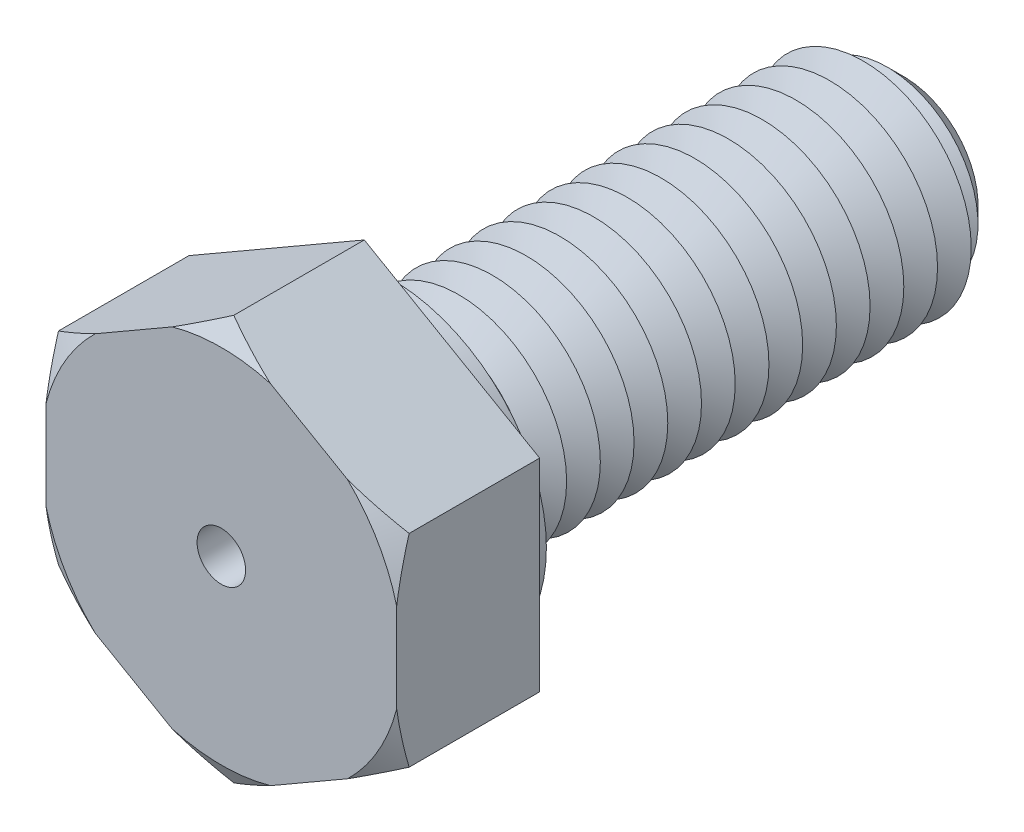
from build123d import *

# Parameters (mm, degrees)
BOSS_EXTRUDE1_DEPTH = 5.3
SKETCH3_R           = 4
BOSS_EXTRUDE2_DEPTH = 20
SKETCH4_R           = 5.75
BOSS_EXTRUDE3_DEPTH = 1
CHAMFER1_SIZE       = 1.25
LPATTERN1_COUNT     = 15
LPATTERN1_PITCH     = 1.25
SKETCH8_R           = 0.9
CUT_EXTRUDE1_DEPTH  = 25.3


with BuildPart() as part:
    # Sketch2 → Boss-Extrude1 (new body)
    with BuildSketch(Plane.XY):
        Polygon((0, 7.505553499), (-6.5, 3.75277675), (-6.5, -3.75277675), (0, -7.505553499), (6.5, -3.75277675), (6.5, 3.75277675), align=None)
    extrude(amount=BOSS_EXTRUDE1_DEPTH)

    # Sketch3 → Boss-Extrude2 (add)
    with BuildSketch(Plane(origin=(0, 0, 0), x_dir=(-1, 0, 0), z_dir=(0, 0, -1))):
        Circle(SKETCH3_R)
    extrude(amount=BOSS_EXTRUDE2_DEPTH)

    # Sketch4 → Boss-Extrude3 (add)
    with BuildSketch(Plane(origin=(0, 0, 0), x_dir=(-1, 0, 0), z_dir=(0, 0, -1))):
        with Locations(Location((0, 0, 0), (0, 0, 180))):
            Circle(SKETCH4_R)
    extrude(amount=BOSS_EXTRUDE3_DEPTH)

    # Chamfer1
    chamfer1_edges = [part.edges().sort_by_distance(p)[0] for p in [
        (4, 0, -20),
    ]]
    chamfer(chamfer1_edges, length=CHAMFER1_SIZE)

    # Sketch6 → Cut-Revolve1 (revolve, cut)
    with BuildSketch(Plane(origin=(0, 0, 0), x_dir=(0, 0, -1), z_dir=(1, 0, 0)), mode=Mode.PRIVATE) as cut_revolve1_sk:
        Polygon((1, 4), (1.625, 2.917468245), (2.25, 4), align=None)
    cut_revolve1 = revolve(cut_revolve1_sk.sketch.rotate(Axis((0, 0, 3.211670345), (0, 0, -1)), 90), axis=Axis((0, 0, 3.211670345), (0, 0, -1)), mode=Mode.SUBTRACT)

    # LPattern1: Cut-Revolve1 ×15
    with Locations(*[(0, 0, -i * LPATTERN1_PITCH) for i in range(1, LPATTERN1_COUNT)]):
        add(cut_revolve1, mode=Mode.SUBTRACT)

    # Sketch7 → Cut-Revolve2 (revolve, cut)
    with BuildSketch(Plane(origin=(0, 0, 0), x_dir=(0, 0, -1), z_dir=(1, 0, 0)), mode=Mode.PRIVATE) as cut_revolve2_sk:
        Polygon((-5.3, 7.505553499), (-5.3, 6.705553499), (-4.838119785, 7.505553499), align=None)
    revolve(cut_revolve2_sk.sketch.rotate(Axis((0, 0, 3.211670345), (0, 0, -1)), 270), axis=Axis((0, 0, 3.211670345), (0, 0, -1)), mode=Mode.SUBTRACT)

    # Sketch8 → Cut-Extrude1 (cut)
    with BuildSketch(Plane.XY.offset(5.3)):
        Circle(SKETCH8_R)
    extrude(amount=-CUT_EXTRUDE1_DEPTH, mode=Mode.SUBTRACT)


solid = part.part
